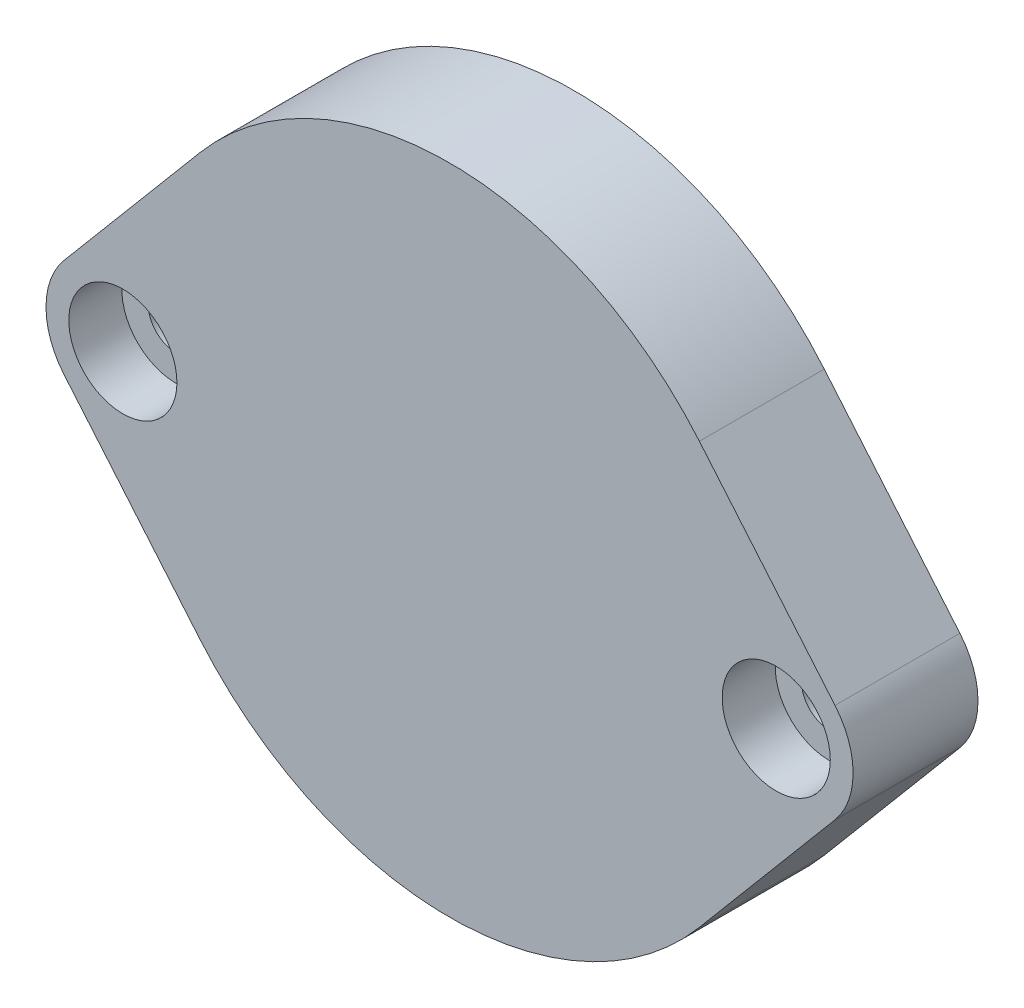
ISO-10303-21;
HEADER;
FILE_DESCRIPTION(('STEP AP214'),'2;1');
FILE_NAME('part.step','',(''),(''),'','','');
FILE_SCHEMA(('AUTOMOTIVE_DESIGN { 1 0 10303 214 1 1 1 1 }'));
ENDSEC;
DATA;
#1=APPLICATION_CONTEXT('core data for automotive mechanical design processes');
#2=APPLICATION_PROTOCOL_DEFINITION('international standard','automotive_design',2000,#1);
#3=PRODUCT_CONTEXT('',#1,'mechanical');
#4=PRODUCT('Part','Part','',(#3));
#5=PRODUCT_RELATED_PRODUCT_CATEGORY('part','',(#4));
#6=PRODUCT_DEFINITION_FORMATION('','',#4);
#7=PRODUCT_DEFINITION_CONTEXT('part definition',#1,'design');
#8=PRODUCT_DEFINITION('design','',#6,#7);
#9=PRODUCT_DEFINITION_SHAPE('','',#8);
#10=(LENGTH_UNIT() NAMED_UNIT(*) SI_UNIT(.MILLI.,.METRE.));
#11=(NAMED_UNIT(*) PLANE_ANGLE_UNIT() SI_UNIT($,.RADIAN.));
#12=(NAMED_UNIT(*) SI_UNIT($,.STERADIAN.) SOLID_ANGLE_UNIT());
#13=UNCERTAINTY_MEASURE_WITH_UNIT(LENGTH_MEASURE(1.E-05),#10,'distance_accuracy_value','');
#14=(GEOMETRIC_REPRESENTATION_CONTEXT(3) GLOBAL_UNCERTAINTY_ASSIGNED_CONTEXT((#13)) GLOBAL_UNIT_ASSIGNED_CONTEXT((#10,
#11,#12)) REPRESENTATION_CONTEXT('',''));
#15=CARTESIAN_POINT('',(0.,0.,0.));
#16=DIRECTION('',(0.,0.,1.));
#17=DIRECTION('',(1.,0.,0.));
#18=AXIS2_PLACEMENT_3D('',#15,#16,#17);
#19=CARTESIAN_POINT('',(-16.51,-13.9121529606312,8.255));
#20=DIRECTION('',(0.764705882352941,0.644379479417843,0.));
#21=DIRECTION('',(-0.644379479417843,0.764705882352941,0.));
#22=AXIS2_PLACEMENT_3D('',#19,#20,#21);
#23=PLANE('',#22);
#24=DIRECTION('',(0.644379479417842,-0.764705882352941,0.));
#25=VECTOR('',#24,1.);
#26=CARTESIAN_POINT('',(-16.51,-13.9121529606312,0.));
#27=LINE('',#26,#25);
#28=CARTESIAN_POINT('',(-25.4747058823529,-3.27344775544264,0.));
#29=VERTEX_POINT('',#28);
#30=CARTESIAN_POINT('',(-16.51,-13.9121529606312,0.));
#31=VERTEX_POINT('',#30);
#32=EDGE_CURVE('E133',#29,#31,#27,.T.);
#33=ORIENTED_EDGE('',*,*,#32,.T.);
#34=DIRECTION('',(0.,0.,-1.));
#35=VECTOR('',#34,1.);
#36=CARTESIAN_POINT('',(-16.51,-13.9121529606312,8.255));
#37=LINE('',#36,#35);
#38=CARTESIAN_POINT('',(-16.51,-13.9121529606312,8.255));
#39=VERTEX_POINT('',#38);
#40=EDGE_CURVE('E11',#39,#31,#37,.T.);
#41=ORIENTED_EDGE('',*,*,#40,.F.);
#42=DIRECTION('',(0.644379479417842,-0.764705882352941,0.));
#43=VECTOR('',#42,1.);
#44=CARTESIAN_POINT('',(-16.51,-13.9121529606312,8.255));
#45=LINE('',#44,#43);
#46=CARTESIAN_POINT('',(-25.4747058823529,-3.27344775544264,8.255));
#47=VERTEX_POINT('',#46);
#48=EDGE_CURVE('E147',#47,#39,#45,.T.);
#49=ORIENTED_EDGE('',*,*,#48,.F.);
#50=DIRECTION('',(0.,0.,-1.));
#51=VECTOR('',#50,1.);
#52=CARTESIAN_POINT('',(-25.4747058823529,-3.27344775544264,8.255));
#53=LINE('',#52,#51);
#54=EDGE_CURVE('E128',#47,#29,#53,.T.);
#55=ORIENTED_EDGE('',*,*,#54,.T.);
#56=EDGE_LOOP('',(#33,#41,#49,#55));
#57=FACE_BOUND('',#56,.T.);
#58=ADVANCED_FACE('F36',(#57),#23,.F.);
#59=CARTESIAN_POINT('',(0.,0.,8.255));
#60=DIRECTION('',(0.,0.,-1.));
#61=DIRECTION('',(-1.,0.,0.));
#62=AXIS2_PLACEMENT_3D('',#59,#60,#61);
#63=CYLINDRICAL_SURFACE('',#62,21.59);
#64=CARTESIAN_POINT('',(0.,0.,0.));
#65=DIRECTION('',(0.,0.,1.));
#66=DIRECTION('',(1.,0.,0.));
#67=AXIS2_PLACEMENT_3D('',#64,#65,#66);
#68=CIRCLE('',#67,21.59);
#69=CARTESIAN_POINT('',(16.51,-13.9121529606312,0.));
#70=VERTEX_POINT('',#69);
#71=EDGE_CURVE('E136',#31,#70,#68,.T.);
#72=ORIENTED_EDGE('',*,*,#71,.T.);
#73=DIRECTION('',(0.,0.,-1.));
#74=VECTOR('',#73,1.);
#75=CARTESIAN_POINT('',(16.51,-13.9121529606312,8.255));
#76=LINE('',#75,#74);
#77=CARTESIAN_POINT('',(16.51,-13.9121529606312,8.255));
#78=VERTEX_POINT('',#77);
#79=EDGE_CURVE('E44',#78,#70,#76,.T.);
#80=ORIENTED_EDGE('',*,*,#79,.F.);
#81=CARTESIAN_POINT('',(0.,0.,8.255));
#82=DIRECTION('',(0.,0.,1.));
#83=DIRECTION('',(1.,0.,0.));
#84=AXIS2_PLACEMENT_3D('',#81,#82,#83);
#85=CIRCLE('',#84,21.59);
#86=EDGE_CURVE('E95',#39,#78,#85,.T.);
#87=ORIENTED_EDGE('',*,*,#86,.F.);
#88=ORIENTED_EDGE('',*,*,#40,.T.);
#89=EDGE_LOOP('',(#72,#80,#87,#88));
#90=FACE_BOUND('',#89,.T.);
#91=ADVANCED_FACE('F228',(#90),#63,.T.);
#92=CARTESIAN_POINT('',(16.51,-13.9121529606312,8.255));
#93=DIRECTION('',(-0.764705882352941,0.644379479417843,0.));
#94=DIRECTION('',(-0.644379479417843,-0.764705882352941,0.));
#95=AXIS2_PLACEMENT_3D('',#92,#93,#94);
#96=PLANE('',#95);
#97=DIRECTION('',(0.644379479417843,0.764705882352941,0.));
#98=VECTOR('',#97,1.);
#99=CARTESIAN_POINT('',(16.51,-13.9121529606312,0.));
#100=LINE('',#99,#98);
#101=CARTESIAN_POINT('',(25.4747058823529,-3.27344775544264,0.));
#102=VERTEX_POINT('',#101);
#103=EDGE_CURVE('E139',#70,#102,#100,.T.);
#104=ORIENTED_EDGE('',*,*,#103,.T.);
#105=DIRECTION('',(0.,0.,-1.));
#106=VECTOR('',#105,1.);
#107=CARTESIAN_POINT('',(25.4747058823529,-3.27344775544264,8.255));
#108=LINE('',#107,#106);
#109=CARTESIAN_POINT('',(25.4747058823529,-3.27344775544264,8.255));
#110=VERTEX_POINT('',#109);
#111=EDGE_CURVE('E154',#110,#102,#108,.T.);
#112=ORIENTED_EDGE('',*,*,#111,.F.);
#113=DIRECTION('',(0.644379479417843,0.764705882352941,0.));
#114=VECTOR('',#113,1.);
#115=CARTESIAN_POINT('',(16.51,-13.9121529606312,8.255));
#116=LINE('',#115,#114);
#117=EDGE_CURVE('E162',#78,#110,#116,.T.);
#118=ORIENTED_EDGE('',*,*,#117,.F.);
#119=ORIENTED_EDGE('',*,*,#79,.T.);
#120=EDGE_LOOP('',(#104,#112,#118,#119));
#121=FACE_BOUND('',#120,.T.);
#122=ADVANCED_FACE('F160',(#121),#96,.F.);
#123=CARTESIAN_POINT('',(21.59,0.,8.255));
#124=DIRECTION('',(0.,0.,-1.));
#125=DIRECTION('',(-1.,0.,0.));
#126=AXIS2_PLACEMENT_3D('',#123,#124,#125);
#127=CYLINDRICAL_SURFACE('',#126,5.08);
#128=CARTESIAN_POINT('',(21.59,0.,0.));
#129=DIRECTION('',(0.,0.,1.));
#130=DIRECTION('',(1.,0.,0.));
#131=AXIS2_PLACEMENT_3D('',#128,#129,#130);
#132=CIRCLE('',#131,5.08);
#133=CARTESIAN_POINT('',(25.4747058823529,3.27344775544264,0.));
#134=VERTEX_POINT('',#133);
#135=EDGE_CURVE('E141',#102,#134,#132,.T.);
#136=ORIENTED_EDGE('',*,*,#135,.T.);
#137=DIRECTION('',(0.,0.,-1.));
#138=VECTOR('',#137,1.);
#139=CARTESIAN_POINT('',(25.4747058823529,3.27344775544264,8.255));
#140=LINE('',#139,#138);
#141=CARTESIAN_POINT('',(25.4747058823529,3.27344775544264,8.255));
#142=VERTEX_POINT('',#141);
#143=EDGE_CURVE('E151',#142,#134,#140,.T.);
#144=ORIENTED_EDGE('',*,*,#143,.F.);
#145=CARTESIAN_POINT('',(21.59,0.,8.255));
#146=DIRECTION('',(0.,0.,1.));
#147=DIRECTION('',(1.,0.,0.));
#148=AXIS2_PLACEMENT_3D('',#145,#146,#147);
#149=CIRCLE('',#148,5.08);
#150=EDGE_CURVE('E174',#110,#142,#149,.T.);
#151=ORIENTED_EDGE('',*,*,#150,.F.);
#152=ORIENTED_EDGE('',*,*,#111,.T.);
#153=EDGE_LOOP('',(#136,#144,#151,#152));
#154=FACE_BOUND('',#153,.T.);
#155=ADVANCED_FACE('F170',(#154),#127,.T.);
#156=CARTESIAN_POINT('',(16.51,13.9121529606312,8.255));
#157=DIRECTION('',(-0.764705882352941,-0.644379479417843,0.));
#158=DIRECTION('',(0.644379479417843,-0.764705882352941,0.));
#159=AXIS2_PLACEMENT_3D('',#156,#157,#158);
#160=PLANE('',#159);
#161=DIRECTION('',(-0.644379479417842,0.764705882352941,0.));
#162=VECTOR('',#161,1.);
#163=CARTESIAN_POINT('',(16.51,13.9121529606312,0.));
#164=LINE('',#163,#162);
#165=CARTESIAN_POINT('',(16.51,13.9121529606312,0.));
#166=VERTEX_POINT('',#165);
#167=EDGE_CURVE('E143',#134,#166,#164,.T.);
#168=ORIENTED_EDGE('',*,*,#167,.T.);
#169=DIRECTION('',(0.,0.,-1.));
#170=VECTOR('',#169,1.);
#171=CARTESIAN_POINT('',(16.51,13.9121529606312,8.255));
#172=LINE('',#171,#170);
#173=CARTESIAN_POINT('',(16.51,13.9121529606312,8.255));
#174=VERTEX_POINT('',#173);
#175=EDGE_CURVE('E123',#174,#166,#172,.T.);
#176=ORIENTED_EDGE('',*,*,#175,.F.);
#177=DIRECTION('',(-0.644379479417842,0.764705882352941,0.));
#178=VECTOR('',#177,1.);
#179=CARTESIAN_POINT('',(16.51,13.9121529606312,8.255));
#180=LINE('',#179,#178);
#181=EDGE_CURVE('E114',#142,#174,#180,.T.);
#182=ORIENTED_EDGE('',*,*,#181,.F.);
#183=ORIENTED_EDGE('',*,*,#143,.T.);
#184=EDGE_LOOP('',(#168,#176,#182,#183));
#185=FACE_BOUND('',#184,.T.);
#186=ADVANCED_FACE('F173',(#185),#160,.F.);
#187=CARTESIAN_POINT('',(-16.51,13.9121529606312,0.));
#188=VERTEX_POINT('',#187);
#189=EDGE_CURVE('E122',#166,#188,#68,.T.);
#190=ORIENTED_EDGE('',*,*,#189,.T.);
#191=DIRECTION('',(0.,0.,-1.));
#192=VECTOR('',#191,1.);
#193=CARTESIAN_POINT('',(-16.51,13.9121529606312,8.255));
#194=LINE('',#193,#192);
#195=CARTESIAN_POINT('',(-16.51,13.9121529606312,8.255));
#196=VERTEX_POINT('',#195);
#197=EDGE_CURVE('E119',#196,#188,#194,.T.);
#198=ORIENTED_EDGE('',*,*,#197,.F.);
#199=EDGE_CURVE('E108',#174,#196,#85,.T.);
#200=ORIENTED_EDGE('',*,*,#199,.F.);
#201=ORIENTED_EDGE('',*,*,#175,.T.);
#202=EDGE_LOOP('',(#190,#198,#200,#201));
#203=FACE_BOUND('',#202,.T.);
#204=ADVANCED_FACE('F120',(#203),#63,.T.);
#205=CARTESIAN_POINT('',(-16.51,13.9121529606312,8.255));
#206=DIRECTION('',(0.764705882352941,-0.644379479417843,0.));
#207=DIRECTION('',(0.644379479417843,0.764705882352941,0.));
#208=AXIS2_PLACEMENT_3D('',#205,#206,#207);
#209=PLANE('',#208);
#210=DIRECTION('',(-0.644379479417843,-0.764705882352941,0.));
#211=VECTOR('',#210,1.);
#212=CARTESIAN_POINT('',(-16.51,13.9121529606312,0.));
#213=LINE('',#212,#211);
#214=CARTESIAN_POINT('',(-25.4747058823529,3.27344775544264,0.));
#215=VERTEX_POINT('',#214);
#216=EDGE_CURVE('E81',#188,#215,#213,.T.);
#217=ORIENTED_EDGE('',*,*,#216,.T.);
#218=DIRECTION('',(0.,0.,-1.));
#219=VECTOR('',#218,1.);
#220=CARTESIAN_POINT('',(-25.4747058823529,3.27344775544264,8.255));
#221=LINE('',#220,#219);
#222=CARTESIAN_POINT('',(-25.4747058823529,3.27344775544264,8.255));
#223=VERTEX_POINT('',#222);
#224=EDGE_CURVE('E124',#223,#215,#221,.T.);
#225=ORIENTED_EDGE('',*,*,#224,.F.);
#226=DIRECTION('',(-0.644379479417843,-0.764705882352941,0.));
#227=VECTOR('',#226,1.);
#228=CARTESIAN_POINT('',(-16.51,13.9121529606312,8.255));
#229=LINE('',#228,#227);
#230=EDGE_CURVE('E112',#196,#223,#229,.T.);
#231=ORIENTED_EDGE('',*,*,#230,.F.);
#232=ORIENTED_EDGE('',*,*,#197,.T.);
#233=EDGE_LOOP('',(#217,#225,#231,#232));
#234=FACE_BOUND('',#233,.T.);
#235=ADVANCED_FACE('F126',(#234),#209,.F.);
#236=CARTESIAN_POINT('',(-21.59,0.,8.255));
#237=DIRECTION('',(0.,0.,-1.));
#238=DIRECTION('',(-1.,0.,0.));
#239=AXIS2_PLACEMENT_3D('',#236,#237,#238);
#240=CYLINDRICAL_SURFACE('',#239,5.08);
#241=CARTESIAN_POINT('',(-21.59,0.,0.));
#242=DIRECTION('',(0.,0.,1.));
#243=DIRECTION('',(1.,0.,0.));
#244=AXIS2_PLACEMENT_3D('',#241,#242,#243);
#245=CIRCLE('',#244,5.08);
#246=EDGE_CURVE('E87',#215,#29,#245,.T.);
#247=ORIENTED_EDGE('',*,*,#246,.T.);
#248=ORIENTED_EDGE('',*,*,#54,.F.);
#249=CARTESIAN_POINT('',(-21.59,0.,8.255));
#250=DIRECTION('',(0.,0.,1.));
#251=DIRECTION('',(1.,0.,0.));
#252=AXIS2_PLACEMENT_3D('',#249,#250,#251);
#253=CIRCLE('',#252,5.08);
#254=EDGE_CURVE('E52',#223,#47,#253,.T.);
#255=ORIENTED_EDGE('',*,*,#254,.F.);
#256=ORIENTED_EDGE('',*,*,#224,.T.);
#257=EDGE_LOOP('',(#247,#248,#255,#256));
#258=FACE_BOUND('',#257,.T.);
#259=ADVANCED_FACE('F206',(#258),#240,.T.);
#260=CARTESIAN_POINT('',(0.,0.,8.255));
#261=DIRECTION('',(0.,0.,1.));
#262=DIRECTION('',(1.,0.,0.));
#263=AXIS2_PLACEMENT_3D('',#260,#261,#262);
#264=PLANE('',#263);
#265=CARTESIAN_POINT('',(-21.59,0.,8.255));
#266=DIRECTION('',(0.,0.,1.));
#267=DIRECTION('',(1.,0.,0.));
#268=AXIS2_PLACEMENT_3D('',#265,#266,#267);
#269=CIRCLE('',#268,3.57250999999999);
#270=CARTESIAN_POINT('',(-18.01749,0.,8.255));
#271=VERTEX_POINT('',#270);
#272=EDGE_CURVE('E198',#271,#271,#269,.T.);
#273=ORIENTED_EDGE('',*,*,#272,.F.);
#274=EDGE_LOOP('',(#273));
#275=FACE_BOUND('',#274,.T.);
#276=CARTESIAN_POINT('',(21.59,0.,8.255));
#277=DIRECTION('',(0.,0.,1.));
#278=DIRECTION('',(1.,0.,0.));
#279=AXIS2_PLACEMENT_3D('',#276,#277,#278);
#280=CIRCLE('',#279,3.57250999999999);
#281=CARTESIAN_POINT('',(25.16251,0.,8.255));
#282=VERTEX_POINT('',#281);
#283=EDGE_CURVE('E186',#282,#282,#280,.T.);
#284=ORIENTED_EDGE('',*,*,#283,.F.);
#285=EDGE_LOOP('',(#284));
#286=FACE_BOUND('',#285,.T.);
#287=ORIENTED_EDGE('',*,*,#48,.T.);
#288=ORIENTED_EDGE('',*,*,#86,.T.);
#289=ORIENTED_EDGE('',*,*,#117,.T.);
#290=ORIENTED_EDGE('',*,*,#150,.T.);
#291=ORIENTED_EDGE('',*,*,#181,.T.);
#292=ORIENTED_EDGE('',*,*,#199,.T.);
#293=ORIENTED_EDGE('',*,*,#230,.T.);
#294=ORIENTED_EDGE('',*,*,#254,.T.);
#295=EDGE_LOOP('',(#287,#288,#289,#290,#291,#292,#293,#294));
#296=FACE_BOUND('',#295,.T.);
#297=ADVANCED_FACE('F110',(#275,#286,#296),#264,.T.);
#298=CARTESIAN_POINT('',(0.,0.,0.));
#299=DIRECTION('',(0.,0.,1.));
#300=DIRECTION('',(1.,0.,0.));
#301=AXIS2_PLACEMENT_3D('',#298,#299,#300);
#302=PLANE('',#301);
#303=CARTESIAN_POINT('',(-21.59,0.,0.));
#304=DIRECTION('',(0.,0.,1.));
#305=DIRECTION('',(1.,0.,0.));
#306=AXIS2_PLACEMENT_3D('',#303,#304,#305);
#307=CIRCLE('',#306,1.8288);
#308=CARTESIAN_POINT('',(-19.7612,0.,0.));
#309=VERTEX_POINT('',#308);
#310=EDGE_CURVE('E189',#309,#309,#307,.T.);
#311=ORIENTED_EDGE('',*,*,#310,.T.);
#312=EDGE_LOOP('',(#311));
#313=FACE_BOUND('',#312,.T.);
#314=CARTESIAN_POINT('',(21.59,0.,0.));
#315=DIRECTION('',(0.,0.,1.));
#316=DIRECTION('',(1.,0.,0.));
#317=AXIS2_PLACEMENT_3D('',#314,#315,#316);
#318=CIRCLE('',#317,1.8288);
#319=CARTESIAN_POINT('',(23.4188,0.,0.));
#320=VERTEX_POINT('',#319);
#321=EDGE_CURVE('E137',#320,#320,#318,.T.);
#322=ORIENTED_EDGE('',*,*,#321,.T.);
#323=EDGE_LOOP('',(#322));
#324=FACE_BOUND('',#323,.T.);
#325=ORIENTED_EDGE('',*,*,#32,.F.);
#326=ORIENTED_EDGE('',*,*,#246,.F.);
#327=ORIENTED_EDGE('',*,*,#216,.F.);
#328=ORIENTED_EDGE('',*,*,#189,.F.);
#329=ORIENTED_EDGE('',*,*,#167,.F.);
#330=ORIENTED_EDGE('',*,*,#135,.F.);
#331=ORIENTED_EDGE('',*,*,#103,.F.);
#332=ORIENTED_EDGE('',*,*,#71,.F.);
#333=EDGE_LOOP('',(#325,#326,#327,#328,#329,#330,#331,#332));
#334=FACE_BOUND('',#333,.T.);
#335=ADVANCED_FACE('F166',(#313,#324,#334),#302,.F.);
#336=CARTESIAN_POINT('',(21.59,0.,8.255));
#337=DIRECTION('',(0.,0.,1.));
#338=DIRECTION('',(1.,0.,0.));
#339=AXIS2_PLACEMENT_3D('',#336,#337,#338);
#340=CYLINDRICAL_SURFACE('',#339,1.8288);
#341=ORIENTED_EDGE('',*,*,#321,.F.);
#342=EDGE_LOOP('',(#341));
#343=FACE_BOUND('',#342,.T.);
#344=CARTESIAN_POINT('',(21.59,0.,4.7498));
#345=DIRECTION('',(0.,0.,1.));
#346=DIRECTION('',(1.,0.,0.));
#347=AXIS2_PLACEMENT_3D('',#344,#345,#346);
#348=CIRCLE('',#347,1.8288);
#349=CARTESIAN_POINT('',(23.4188,0.,4.7498));
#350=VERTEX_POINT('',#349);
#351=EDGE_CURVE('E180',#350,#350,#348,.T.);
#352=ORIENTED_EDGE('',*,*,#351,.T.);
#353=EDGE_LOOP('',(#352));
#354=FACE_BOUND('',#353,.T.);
#355=ADVANCED_FACE('F223',(#343,#354),#340,.F.);
#356=CARTESIAN_POINT('',(23.4188,0.,4.7498));
#357=DIRECTION('',(0.,0.,-1.));
#358=DIRECTION('',(-1.,0.,0.));
#359=AXIS2_PLACEMENT_3D('',#356,#357,#358);
#360=PLANE('',#359);
#361=ORIENTED_EDGE('',*,*,#351,.F.);
#362=EDGE_LOOP('',(#361));
#363=FACE_BOUND('',#362,.T.);
#364=CARTESIAN_POINT('',(21.59,0.,4.7498));
#365=DIRECTION('',(0.,0.,1.));
#366=DIRECTION('',(1.,0.,0.));
#367=AXIS2_PLACEMENT_3D('',#364,#365,#366);
#368=CIRCLE('',#367,3.57250999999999);
#369=CARTESIAN_POINT('',(25.16251,0.,4.7498));
#370=VERTEX_POINT('',#369);
#371=EDGE_CURVE('E183',#370,#370,#368,.T.);
#372=ORIENTED_EDGE('',*,*,#371,.T.);
#373=EDGE_LOOP('',(#372));
#374=FACE_BOUND('',#373,.T.);
#375=ADVANCED_FACE('F213',(#363,#374),#360,.F.);
#376=CARTESIAN_POINT('',(21.59,0.,8.255));
#377=DIRECTION('',(0.,0.,1.));
#378=DIRECTION('',(1.,0.,0.));
#379=AXIS2_PLACEMENT_3D('',#376,#377,#378);
#380=CYLINDRICAL_SURFACE('',#379,3.57250999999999);
#381=ORIENTED_EDGE('',*,*,#371,.F.);
#382=EDGE_LOOP('',(#381));
#383=FACE_BOUND('',#382,.T.);
#384=ORIENTED_EDGE('',*,*,#283,.T.);
#385=EDGE_LOOP('',(#384));
#386=FACE_BOUND('',#385,.T.);
#387=ADVANCED_FACE('F210',(#383,#386),#380,.F.);
#388=CARTESIAN_POINT('',(-21.59,0.,8.255));
#389=DIRECTION('',(0.,0.,1.));
#390=DIRECTION('',(1.,0.,0.));
#391=AXIS2_PLACEMENT_3D('',#388,#389,#390);
#392=CYLINDRICAL_SURFACE('',#391,1.8288);
#393=ORIENTED_EDGE('',*,*,#310,.F.);
#394=EDGE_LOOP('',(#393));
#395=FACE_BOUND('',#394,.T.);
#396=CARTESIAN_POINT('',(-21.59,0.,4.7498));
#397=DIRECTION('',(0.,0.,1.));
#398=DIRECTION('',(1.,0.,0.));
#399=AXIS2_PLACEMENT_3D('',#396,#397,#398);
#400=CIRCLE('',#399,1.8288);
#401=CARTESIAN_POINT('',(-19.7612,0.,4.7498));
#402=VERTEX_POINT('',#401);
#403=EDGE_CURVE('E192',#402,#402,#400,.T.);
#404=ORIENTED_EDGE('',*,*,#403,.T.);
#405=EDGE_LOOP('',(#404));
#406=FACE_BOUND('',#405,.T.);
#407=ADVANCED_FACE('F212',(#395,#406),#392,.F.);
#408=CARTESIAN_POINT('',(-19.7612,0.,4.7498));
#409=DIRECTION('',(0.,0.,-1.));
#410=DIRECTION('',(-1.,0.,0.));
#411=AXIS2_PLACEMENT_3D('',#408,#409,#410);
#412=PLANE('',#411);
#413=ORIENTED_EDGE('',*,*,#403,.F.);
#414=EDGE_LOOP('',(#413));
#415=FACE_BOUND('',#414,.T.);
#416=CARTESIAN_POINT('',(-21.59,0.,4.7498));
#417=DIRECTION('',(0.,0.,1.));
#418=DIRECTION('',(1.,0.,0.));
#419=AXIS2_PLACEMENT_3D('',#416,#417,#418);
#420=CIRCLE('',#419,3.57250999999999);
#421=CARTESIAN_POINT('',(-18.01749,0.,4.7498));
#422=VERTEX_POINT('',#421);
#423=EDGE_CURVE('E195',#422,#422,#420,.T.);
#424=ORIENTED_EDGE('',*,*,#423,.T.);
#425=EDGE_LOOP('',(#424));
#426=FACE_BOUND('',#425,.T.);
#427=ADVANCED_FACE('F220',(#415,#426),#412,.F.);
#428=CARTESIAN_POINT('',(-21.59,0.,8.255));
#429=DIRECTION('',(0.,0.,1.));
#430=DIRECTION('',(1.,0.,0.));
#431=AXIS2_PLACEMENT_3D('',#428,#429,#430);
#432=CYLINDRICAL_SURFACE('',#431,3.57250999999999);
#433=ORIENTED_EDGE('',*,*,#423,.F.);
#434=EDGE_LOOP('',(#433));
#435=FACE_BOUND('',#434,.T.);
#436=ORIENTED_EDGE('',*,*,#272,.T.);
#437=EDGE_LOOP('',(#436));
#438=FACE_BOUND('',#437,.T.);
#439=ADVANCED_FACE('F202',(#435,#438),#432,.F.);
#440=CLOSED_SHELL('',(#58,#91,#122,#155,#186,#204,#235,#259,#297,#335,#355,#375,#387,#407,#427,#439));
#441=MANIFOLD_SOLID_BREP('B2',#440);
#442=ADVANCED_BREP_SHAPE_REPRESENTATION('',(#18,#441),#14);
#443=SHAPE_DEFINITION_REPRESENTATION(#9,#442);
ENDSEC;
END-ISO-10303-21;
